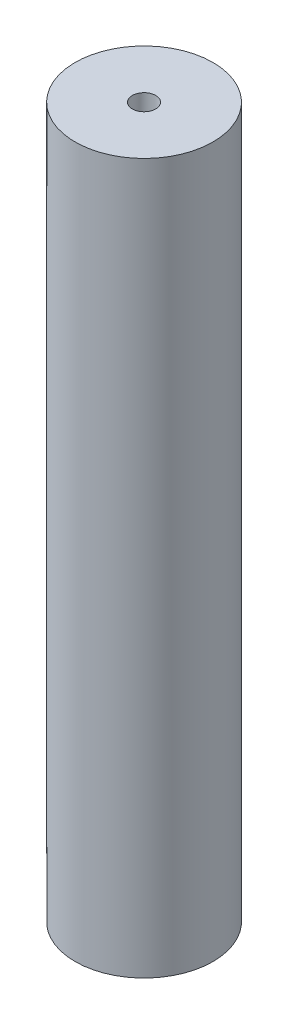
ISO-10303-21;
HEADER;
FILE_DESCRIPTION(('STEP AP214'),'2;1');
FILE_NAME('part.step','',(''),(''),'','','');
FILE_SCHEMA(('AUTOMOTIVE_DESIGN { 1 0 10303 214 1 1 1 1 }'));
ENDSEC;
DATA;
#1=APPLICATION_CONTEXT('core data for automotive mechanical design processes');
#2=APPLICATION_PROTOCOL_DEFINITION('international standard','automotive_design',2000,#1);
#3=PRODUCT_CONTEXT('',#1,'mechanical');
#4=PRODUCT('Part','Part','',(#3));
#5=PRODUCT_RELATED_PRODUCT_CATEGORY('part','',(#4));
#6=PRODUCT_DEFINITION_FORMATION('','',#4);
#7=PRODUCT_DEFINITION_CONTEXT('part definition',#1,'design');
#8=PRODUCT_DEFINITION('design','',#6,#7);
#9=PRODUCT_DEFINITION_SHAPE('','',#8);
#10=(LENGTH_UNIT() NAMED_UNIT(*) SI_UNIT(.MILLI.,.METRE.));
#11=(NAMED_UNIT(*) PLANE_ANGLE_UNIT() SI_UNIT($,.RADIAN.));
#12=(NAMED_UNIT(*) SI_UNIT($,.STERADIAN.) SOLID_ANGLE_UNIT());
#13=UNCERTAINTY_MEASURE_WITH_UNIT(LENGTH_MEASURE(1.E-05),#10,'distance_accuracy_value','');
#14=(GEOMETRIC_REPRESENTATION_CONTEXT(3) GLOBAL_UNCERTAINTY_ASSIGNED_CONTEXT((#13)) GLOBAL_UNIT_ASSIGNED_CONTEXT((#10,
#11,#12)) REPRESENTATION_CONTEXT('',''));
#15=CARTESIAN_POINT('',(0.,0.,0.));
#16=DIRECTION('',(0.,0.,1.));
#17=DIRECTION('',(1.,0.,0.));
#18=AXIS2_PLACEMENT_3D('',#15,#16,#17);
#19=CARTESIAN_POINT('',(15.,117.,130.));
#20=DIRECTION('',(0.,1.,0.));
#21=DIRECTION('',(0.,0.,1.));
#22=AXIS2_PLACEMENT_3D('',#19,#20,#21);
#23=PLANE('',#22);
#24=CARTESIAN_POINT('',(15.,117.,130.));
#25=DIRECTION('',(0.,1.,0.));
#26=DIRECTION('',(0.,0.,1.));
#27=AXIS2_PLACEMENT_3D('',#24,#25,#26);
#28=CIRCLE('',#27,1.6);
#29=CARTESIAN_POINT('',(15.,117.,131.6));
#30=VERTEX_POINT('',#29);
#31=EDGE_CURVE('E54',#30,#30,#28,.T.);
#32=ORIENTED_EDGE('',*,*,#31,.T.);
#33=EDGE_LOOP('',(#32));
#34=FACE_BOUND('',#33,.T.);
#35=CARTESIAN_POINT('',(15.,117.,130.));
#36=DIRECTION('',(0.,1.,0.));
#37=DIRECTION('',(0.,0.,1.));
#38=AXIS2_PLACEMENT_3D('',#35,#36,#37);
#39=CIRCLE('',#38,10.);
#40=CARTESIAN_POINT('',(15.,117.,140.));
#41=VERTEX_POINT('',#40);
#42=EDGE_CURVE('E42',#41,#41,#39,.T.);
#43=ORIENTED_EDGE('',*,*,#42,.F.);
#44=EDGE_LOOP('',(#43));
#45=FACE_BOUND('',#44,.T.);
#46=ADVANCED_FACE('F34',(#34,#45),#23,.F.);
#47=CARTESIAN_POINT('',(15.,248.284271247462,130.));
#48=DIRECTION('',(0.,-1.,0.));
#49=DIRECTION('',(0.,0.,-1.));
#50=AXIS2_PLACEMENT_3D('',#47,#48,#49);
#51=CYLINDRICAL_SURFACE('',#50,10.);
#52=CARTESIAN_POINT('',(15.,220.,130.));
#53=DIRECTION('',(0.,-1.,0.));
#54=DIRECTION('',(0.,0.,-1.));
#55=AXIS2_PLACEMENT_3D('',#52,#53,#54);
#56=CIRCLE('',#55,10.);
#57=CARTESIAN_POINT('',(15.,220.,120.));
#58=VERTEX_POINT('',#57);
#59=EDGE_CURVE('E12',#58,#58,#56,.T.);
#60=ORIENTED_EDGE('',*,*,#59,.T.);
#61=EDGE_LOOP('',(#60));
#62=FACE_BOUND('',#61,.T.);
#63=ORIENTED_EDGE('',*,*,#42,.T.);
#64=EDGE_LOOP('',(#63));
#65=FACE_BOUND('',#64,.T.);
#66=ADVANCED_FACE('F67',(#62,#65),#51,.T.);
#67=CARTESIAN_POINT('',(0.,220.,0.));
#68=DIRECTION('',(0.,-1.,0.));
#69=DIRECTION('',(0.,0.,-1.));
#70=AXIS2_PLACEMENT_3D('',#67,#68,#69);
#71=PLANE('',#70);
#72=CARTESIAN_POINT('',(15.,220.,130.));
#73=DIRECTION('',(0.,-1.,0.));
#74=DIRECTION('',(0.,0.,-1.));
#75=AXIS2_PLACEMENT_3D('',#72,#73,#74);
#76=CIRCLE('',#75,1.7);
#77=CARTESIAN_POINT('',(15.,220.,128.3));
#78=VERTEX_POINT('',#77);
#79=EDGE_CURVE('E53',#78,#78,#76,.T.);
#80=ORIENTED_EDGE('',*,*,#79,.T.);
#81=EDGE_LOOP('',(#80));
#82=FACE_BOUND('',#81,.T.);
#83=ORIENTED_EDGE('',*,*,#59,.F.);
#84=EDGE_LOOP('',(#83));
#85=FACE_BOUND('',#84,.T.);
#86=ADVANCED_FACE('F73',(#82,#85),#71,.F.);
#87=CARTESIAN_POINT('',(15.,229.,130.));
#88=DIRECTION('',(0.,1.,0.));
#89=DIRECTION('',(0.,0.,1.));
#90=AXIS2_PLACEMENT_3D('',#87,#88,#89);
#91=CYLINDRICAL_SURFACE('',#90,1.7);
#92=CARTESIAN_POINT('',(15.,208.166633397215,130.));
#93=DIRECTION('',(0.,1.,0.));
#94=DIRECTION('',(0.,0.,1.));
#95=AXIS2_PLACEMENT_3D('',#92,#93,#94);
#96=CIRCLE('',#95,1.7);
#97=CARTESIAN_POINT('',(15.,208.166633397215,131.7));
#98=VERTEX_POINT('',#97);
#99=EDGE_CURVE('E38',#98,#98,#96,.T.);
#100=ORIENTED_EDGE('',*,*,#99,.F.);
#101=EDGE_LOOP('',(#100));
#102=FACE_BOUND('',#101,.T.);
#103=ORIENTED_EDGE('',*,*,#79,.F.);
#104=EDGE_LOOP('',(#103));
#105=FACE_BOUND('',#104,.T.);
#106=ADVANCED_FACE('F49',(#102,#105),#91,.F.);
#107=CARTESIAN_POINT('',(15.,207.857167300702,130.));
#108=DIRECTION('',(0.,1.,0.));
#109=DIRECTION('',(0.,0.,1.));
#110=AXIS2_PLACEMENT_3D('',#107,#108,#109);
#111=CONICAL_SURFACE('',#110,1.18496192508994,1.02974425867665);
#112=CARTESIAN_POINT('',(15.,207.145170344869,130.));
#113=VERTEX_POINT('',#112);
#114=VERTEX_LOOP('',#113);
#115=FACE_BOUND('',#114,.T.);
#116=ORIENTED_EDGE('',*,*,#99,.T.);
#117=EDGE_LOOP('',(#116));
#118=FACE_BOUND('',#117,.T.);
#119=ADVANCED_FACE('F36',(#115,#118),#111,.F.);
#120=CARTESIAN_POINT('',(15.,99.5,130.));
#121=DIRECTION('',(0.,1.,0.));
#122=DIRECTION('',(0.,0.,1.));
#123=AXIS2_PLACEMENT_3D('',#120,#121,#122);
#124=CYLINDRICAL_SURFACE('',#123,1.6);
#125=CARTESIAN_POINT('',(15.,129.5,130.));
#126=DIRECTION('',(0.,1.,0.));
#127=DIRECTION('',(0.,0.,1.));
#128=AXIS2_PLACEMENT_3D('',#125,#126,#127);
#129=CIRCLE('',#128,1.6);
#130=CARTESIAN_POINT('',(15.,129.5,131.6));
#131=VERTEX_POINT('',#130);
#132=EDGE_CURVE('E58',#131,#131,#129,.T.);
#133=ORIENTED_EDGE('',*,*,#132,.T.);
#134=EDGE_LOOP('',(#133));
#135=FACE_BOUND('',#134,.T.);
#136=ORIENTED_EDGE('',*,*,#31,.F.);
#137=EDGE_LOOP('',(#136));
#138=FACE_BOUND('',#137,.T.);
#139=ADVANCED_FACE('F48',(#135,#138),#124,.F.);
#140=CARTESIAN_POINT('',(15.,129.5,130.));
#141=DIRECTION('',(0.,1.,0.));
#142=DIRECTION('',(0.,0.,1.));
#143=AXIS2_PLACEMENT_3D('',#140,#141,#142);
#144=PLANE('',#143);
#145=ORIENTED_EDGE('',*,*,#132,.F.);
#146=EDGE_LOOP('',(#145));
#147=FACE_BOUND('',#146,.T.);
#148=ADVANCED_FACE('F84',(#147),#144,.F.);
#149=CLOSED_SHELL('',(#46,#66,#86,#106,#119,#139,#148));
#150=MANIFOLD_SOLID_BREP('B2',#149);
#151=ADVANCED_BREP_SHAPE_REPRESENTATION('',(#18,#150),#14);
#152=SHAPE_DEFINITION_REPRESENTATION(#9,#151);
ENDSEC;
END-ISO-10303-21;
